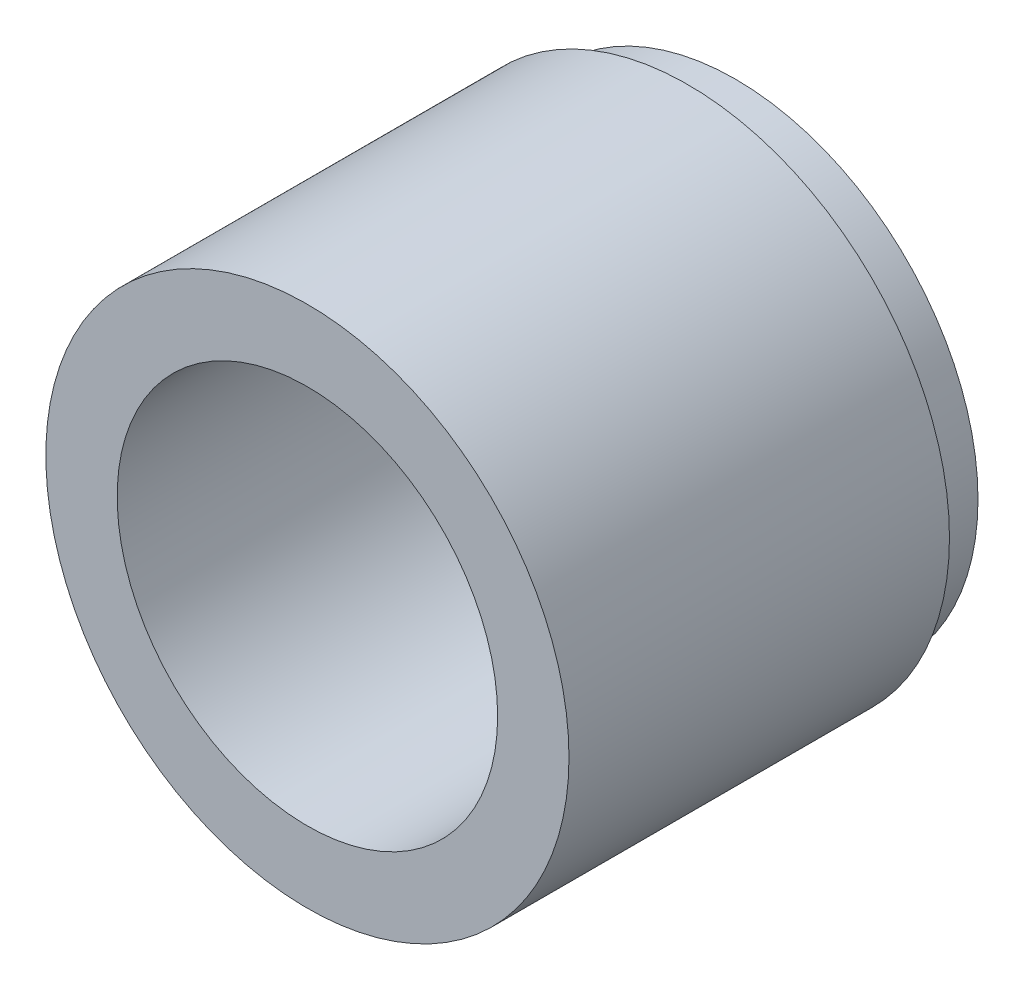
from build123d import *

# Parameters (mm, degrees)
SKETCH1_R           = 27.5
BOSS_EXTRUDE1_DEPTH = 40
SKETCH2_R           = 20
CUT_EXTRUDE1_DEPTH  = 34
SKETCH3_R           = 25.5
BOSS_EXTRUDE2_DEPTH = 5
SKETCH4_R           = 18
CUT_EXTRUDE2_DEPTH  = 30


with BuildPart() as part:
    # Sketch1 → Boss-Extrude1 (new body)
    with BuildSketch(Plane.XY):
        Circle(SKETCH1_R)
    extrude(amount=BOSS_EXTRUDE1_DEPTH)

    # Sketch2 → Cut-Extrude1 (cut)
    with BuildSketch(Plane.XY.offset(40)):
        Circle(SKETCH2_R)
    extrude(amount=-CUT_EXTRUDE1_DEPTH, mode=Mode.SUBTRACT)

    # Sketch3 → Boss-Extrude2 (add)
    with BuildSketch(Plane(origin=(0, 0, 0), x_dir=(-1, 0, 0), z_dir=(0, 0, -1))):
        with Locations(Location((0, 0, 0), (0, 0, 180))):
            Circle(SKETCH3_R)
    extrude(amount=BOSS_EXTRUDE2_DEPTH)

    # Sketch4 → Cut-Extrude2 (cut)
    with BuildSketch(Plane(origin=(0, 0, -5), x_dir=(-1, 0, 0), z_dir=(0, 0, -1))):
        Circle(SKETCH4_R)
    extrude(amount=-CUT_EXTRUDE2_DEPTH, mode=Mode.SUBTRACT)


solid = part.part
